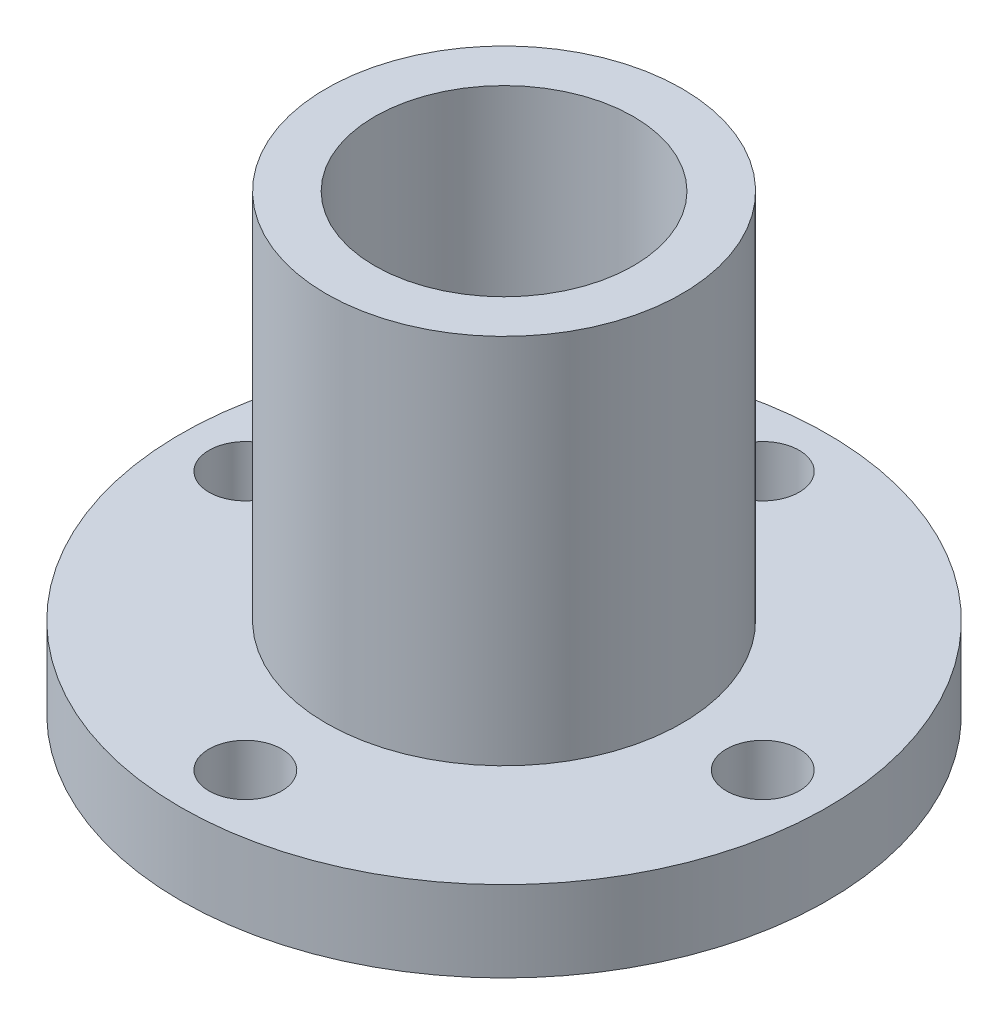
ISO-10303-21;
HEADER;
FILE_DESCRIPTION(('STEP AP214'),'2;1');
FILE_NAME('part.step','',(''),(''),'','','');
FILE_SCHEMA(('AUTOMOTIVE_DESIGN { 1 0 10303 214 1 1 1 1 }'));
ENDSEC;
DATA;
#1=APPLICATION_CONTEXT('core data for automotive mechanical design processes');
#2=APPLICATION_PROTOCOL_DEFINITION('international standard','automotive_design',2000,#1);
#3=PRODUCT_CONTEXT('',#1,'mechanical');
#4=PRODUCT('Part','Part','',(#3));
#5=PRODUCT_RELATED_PRODUCT_CATEGORY('part','',(#4));
#6=PRODUCT_DEFINITION_FORMATION('','',#4);
#7=PRODUCT_DEFINITION_CONTEXT('part definition',#1,'design');
#8=PRODUCT_DEFINITION('design','',#6,#7);
#9=PRODUCT_DEFINITION_SHAPE('','',#8);
#10=(LENGTH_UNIT() NAMED_UNIT(*) SI_UNIT(.MILLI.,.METRE.));
#11=(NAMED_UNIT(*) PLANE_ANGLE_UNIT() SI_UNIT($,.RADIAN.));
#12=(NAMED_UNIT(*) SI_UNIT($,.STERADIAN.) SOLID_ANGLE_UNIT());
#13=UNCERTAINTY_MEASURE_WITH_UNIT(LENGTH_MEASURE(1.E-05),#10,'distance_accuracy_value','');
#14=(GEOMETRIC_REPRESENTATION_CONTEXT(3) GLOBAL_UNCERTAINTY_ASSIGNED_CONTEXT((#13)) GLOBAL_UNIT_ASSIGNED_CONTEXT((#10,
#11,#12)) REPRESENTATION_CONTEXT('',''));
#15=CARTESIAN_POINT('',(0.,0.,0.));
#16=DIRECTION('',(0.,0.,1.));
#17=DIRECTION('',(1.,0.,0.));
#18=AXIS2_PLACEMENT_3D('',#15,#16,#17);
#19=CARTESIAN_POINT('',(0.,28.,0.));
#20=DIRECTION('',(0.,-1.,0.));
#21=DIRECTION('',(0.,0.,-1.));
#22=AXIS2_PLACEMENT_3D('',#19,#20,#21);
#23=CYLINDRICAL_SURFACE('',#22,20.);
#24=CARTESIAN_POINT('',(0.,0.,0.));
#25=DIRECTION('',(0.,1.,0.));
#26=DIRECTION('',(0.,0.,1.));
#27=AXIS2_PLACEMENT_3D('',#24,#25,#26);
#28=CIRCLE('',#27,20.);
#29=CARTESIAN_POINT('',(0.,0.,20.));
#30=VERTEX_POINT('',#29);
#31=EDGE_CURVE('E11',#30,#30,#28,.T.);
#32=ORIENTED_EDGE('',*,*,#31,.T.);
#33=EDGE_LOOP('',(#32));
#34=FACE_BOUND('',#33,.T.);
#35=CARTESIAN_POINT('',(0.,5.,0.));
#36=DIRECTION('',(0.,1.,0.));
#37=DIRECTION('',(0.,0.,1.));
#38=AXIS2_PLACEMENT_3D('',#35,#36,#37);
#39=CIRCLE('',#38,20.);
#40=CARTESIAN_POINT('',(0.,5.,20.));
#41=VERTEX_POINT('',#40);
#42=EDGE_CURVE('E43',#41,#41,#39,.T.);
#43=ORIENTED_EDGE('',*,*,#42,.F.);
#44=EDGE_LOOP('',(#43));
#45=FACE_BOUND('',#44,.T.);
#46=ADVANCED_FACE('F37',(#34,#45),#23,.T.);
#47=CARTESIAN_POINT('',(0.,0.,0.));
#48=DIRECTION('',(0.,1.,0.));
#49=DIRECTION('',(0.,0.,1.));
#50=AXIS2_PLACEMENT_3D('',#47,#48,#49);
#51=PLANE('',#50);
#52=CARTESIAN_POINT('',(0.,0.,16.));
#53=DIRECTION('',(0.,-1.,0.));
#54=DIRECTION('',(0.,0.,-1.));
#55=AXIS2_PLACEMENT_3D('',#52,#53,#54);
#56=CIRCLE('',#55,2.25);
#57=CARTESIAN_POINT('',(0.,0.,13.75));
#58=VERTEX_POINT('',#57);
#59=EDGE_CURVE('E85',#58,#58,#56,.T.);
#60=ORIENTED_EDGE('',*,*,#59,.F.);
#61=EDGE_LOOP('',(#60));
#62=FACE_BOUND('',#61,.T.);
#63=CARTESIAN_POINT('',(16.,0.,0.));
#64=DIRECTION('',(0.,-1.,0.));
#65=DIRECTION('',(0.,0.,-1.));
#66=AXIS2_PLACEMENT_3D('',#63,#64,#65);
#67=CIRCLE('',#66,2.25);
#68=CARTESIAN_POINT('',(16.,0.,-2.25));
#69=VERTEX_POINT('',#68);
#70=EDGE_CURVE('E79',#69,#69,#67,.T.);
#71=ORIENTED_EDGE('',*,*,#70,.F.);
#72=EDGE_LOOP('',(#71));
#73=FACE_BOUND('',#72,.T.);
#74=CARTESIAN_POINT('',(0.,0.,-16.));
#75=DIRECTION('',(0.,-1.,0.));
#76=DIRECTION('',(0.,0.,1.));
#77=AXIS2_PLACEMENT_3D('',#74,#75,#76);
#78=CIRCLE('',#77,2.25);
#79=CARTESIAN_POINT('',(0.,0.,-13.75));
#80=VERTEX_POINT('',#79);
#81=EDGE_CURVE('E74',#80,#80,#78,.T.);
#82=ORIENTED_EDGE('',*,*,#81,.F.);
#83=EDGE_LOOP('',(#82));
#84=FACE_BOUND('',#83,.T.);
#85=CARTESIAN_POINT('',(-16.,0.,0.));
#86=DIRECTION('',(0.,-1.,0.));
#87=DIRECTION('',(0.,0.,1.));
#88=AXIS2_PLACEMENT_3D('',#85,#86,#87);
#89=CIRCLE('',#88,2.25);
#90=CARTESIAN_POINT('',(-16.,0.,2.25));
#91=VERTEX_POINT('',#90);
#92=EDGE_CURVE('E67',#91,#91,#89,.T.);
#93=ORIENTED_EDGE('',*,*,#92,.F.);
#94=EDGE_LOOP('',(#93));
#95=FACE_BOUND('',#94,.T.);
#96=CARTESIAN_POINT('',(0.,0.,0.));
#97=DIRECTION('',(0.,1.,0.));
#98=DIRECTION('',(0.,0.,1.));
#99=AXIS2_PLACEMENT_3D('',#96,#97,#98);
#100=CIRCLE('',#99,8.);
#101=CARTESIAN_POINT('',(0.,0.,8.));
#102=VERTEX_POINT('',#101);
#103=EDGE_CURVE('E54',#102,#102,#100,.T.);
#104=ORIENTED_EDGE('',*,*,#103,.T.);
#105=EDGE_LOOP('',(#104));
#106=FACE_BOUND('',#105,.T.);
#107=ORIENTED_EDGE('',*,*,#31,.F.);
#108=EDGE_LOOP('',(#107));
#109=FACE_BOUND('',#108,.T.);
#110=ADVANCED_FACE('F96',(#62,#73,#84,#95,#106,#109),#51,.F.);
#111=CARTESIAN_POINT('',(0.,5.,0.));
#112=DIRECTION('',(0.,1.,0.));
#113=DIRECTION('',(0.,0.,1.));
#114=AXIS2_PLACEMENT_3D('',#111,#112,#113);
#115=PLANE('',#114);
#116=CARTESIAN_POINT('',(0.,5.,16.));
#117=DIRECTION('',(0.,-1.,0.));
#118=DIRECTION('',(0.,0.,-1.));
#119=AXIS2_PLACEMENT_3D('',#116,#117,#118);
#120=CIRCLE('',#119,2.25);
#121=CARTESIAN_POINT('',(0.,5.,13.75));
#122=VERTEX_POINT('',#121);
#123=EDGE_CURVE('E62',#122,#122,#120,.T.);
#124=ORIENTED_EDGE('',*,*,#123,.T.);
#125=EDGE_LOOP('',(#124));
#126=FACE_BOUND('',#125,.T.);
#127=CARTESIAN_POINT('',(16.,5.,0.));
#128=DIRECTION('',(0.,-1.,0.));
#129=DIRECTION('',(0.,0.,-1.));
#130=AXIS2_PLACEMENT_3D('',#127,#128,#129);
#131=CIRCLE('',#130,2.25);
#132=CARTESIAN_POINT('',(16.,5.,-2.25));
#133=VERTEX_POINT('',#132);
#134=EDGE_CURVE('E77',#133,#133,#131,.T.);
#135=ORIENTED_EDGE('',*,*,#134,.T.);
#136=EDGE_LOOP('',(#135));
#137=FACE_BOUND('',#136,.T.);
#138=CARTESIAN_POINT('',(0.,5.,-16.));
#139=DIRECTION('',(0.,-1.,0.));
#140=DIRECTION('',(0.,0.,1.));
#141=AXIS2_PLACEMENT_3D('',#138,#139,#140);
#142=CIRCLE('',#141,2.25);
#143=CARTESIAN_POINT('',(0.,5.,-13.75));
#144=VERTEX_POINT('',#143);
#145=EDGE_CURVE('E70',#144,#144,#142,.T.);
#146=ORIENTED_EDGE('',*,*,#145,.T.);
#147=EDGE_LOOP('',(#146));
#148=FACE_BOUND('',#147,.T.);
#149=CARTESIAN_POINT('',(-16.,5.,0.));
#150=DIRECTION('',(0.,-1.,0.));
#151=DIRECTION('',(0.,0.,1.));
#152=AXIS2_PLACEMENT_3D('',#149,#150,#151);
#153=CIRCLE('',#152,2.25);
#154=CARTESIAN_POINT('',(-16.,5.,2.25));
#155=VERTEX_POINT('',#154);
#156=EDGE_CURVE('E61',#155,#155,#153,.T.);
#157=ORIENTED_EDGE('',*,*,#156,.T.);
#158=EDGE_LOOP('',(#157));
#159=FACE_BOUND('',#158,.T.);
#160=CARTESIAN_POINT('',(0.,5.,0.));
#161=DIRECTION('',(0.,1.,0.));
#162=DIRECTION('',(0.,0.,1.));
#163=AXIS2_PLACEMENT_3D('',#160,#161,#162);
#164=CIRCLE('',#163,11.);
#165=CARTESIAN_POINT('',(0.,5.,11.));
#166=VERTEX_POINT('',#165);
#167=EDGE_CURVE('E49',#166,#166,#164,.T.);
#168=ORIENTED_EDGE('',*,*,#167,.F.);
#169=EDGE_LOOP('',(#168));
#170=FACE_BOUND('',#169,.T.);
#171=ORIENTED_EDGE('',*,*,#42,.T.);
#172=EDGE_LOOP('',(#171));
#173=FACE_BOUND('',#172,.T.);
#174=ADVANCED_FACE('F89',(#126,#137,#148,#159,#170,#173),#115,.T.);
#175=CARTESIAN_POINT('',(0.,5.,0.));
#176=DIRECTION('',(0.,1.,0.));
#177=DIRECTION('',(0.,0.,1.));
#178=AXIS2_PLACEMENT_3D('',#175,#176,#177);
#179=CYLINDRICAL_SURFACE('',#178,11.);
#180=ORIENTED_EDGE('',*,*,#167,.T.);
#181=EDGE_LOOP('',(#180));
#182=FACE_BOUND('',#181,.T.);
#183=CARTESIAN_POINT('',(0.,28.,0.));
#184=DIRECTION('',(0.,1.,0.));
#185=DIRECTION('',(0.,0.,1.));
#186=AXIS2_PLACEMENT_3D('',#183,#184,#185);
#187=CIRCLE('',#186,11.);
#188=CARTESIAN_POINT('',(0.,28.,11.));
#189=VERTEX_POINT('',#188);
#190=EDGE_CURVE('E55',#189,#189,#187,.T.);
#191=ORIENTED_EDGE('',*,*,#190,.F.);
#192=EDGE_LOOP('',(#191));
#193=FACE_BOUND('',#192,.T.);
#194=ADVANCED_FACE('F119',(#182,#193),#179,.T.);
#195=CARTESIAN_POINT('',(0.,28.,0.));
#196=DIRECTION('',(0.,1.,0.));
#197=DIRECTION('',(0.,0.,1.));
#198=AXIS2_PLACEMENT_3D('',#195,#196,#197);
#199=PLANE('',#198);
#200=CARTESIAN_POINT('',(0.,28.,0.));
#201=DIRECTION('',(0.,1.,0.));
#202=DIRECTION('',(0.,0.,1.));
#203=AXIS2_PLACEMENT_3D('',#200,#201,#202);
#204=CIRCLE('',#203,8.);
#205=CARTESIAN_POINT('',(0.,28.,8.));
#206=VERTEX_POINT('',#205);
#207=EDGE_CURVE('E59',#206,#206,#204,.T.);
#208=ORIENTED_EDGE('',*,*,#207,.F.);
#209=EDGE_LOOP('',(#208));
#210=FACE_BOUND('',#209,.T.);
#211=ORIENTED_EDGE('',*,*,#190,.T.);
#212=EDGE_LOOP('',(#211));
#213=FACE_BOUND('',#212,.T.);
#214=ADVANCED_FACE('F112',(#210,#213),#199,.T.);
#215=CARTESIAN_POINT('',(0.,0.,0.));
#216=DIRECTION('',(0.,1.,0.));
#217=DIRECTION('',(0.,0.,1.));
#218=AXIS2_PLACEMENT_3D('',#215,#216,#217);
#219=CYLINDRICAL_SURFACE('',#218,8.);
#220=ORIENTED_EDGE('',*,*,#103,.F.);
#221=EDGE_LOOP('',(#220));
#222=FACE_BOUND('',#221,.T.);
#223=ORIENTED_EDGE('',*,*,#207,.T.);
#224=EDGE_LOOP('',(#223));
#225=FACE_BOUND('',#224,.T.);
#226=ADVANCED_FACE('F109',(#222,#225),#219,.F.);
#227=CARTESIAN_POINT('',(-16.,5.,0.));
#228=DIRECTION('',(0.,-1.,0.));
#229=DIRECTION('',(0.,0.,-1.));
#230=AXIS2_PLACEMENT_3D('',#227,#228,#229);
#231=CYLINDRICAL_SURFACE('',#230,2.25);
#232=ORIENTED_EDGE('',*,*,#156,.F.);
#233=EDGE_LOOP('',(#232));
#234=FACE_BOUND('',#233,.T.);
#235=ORIENTED_EDGE('',*,*,#92,.T.);
#236=EDGE_LOOP('',(#235));
#237=FACE_BOUND('',#236,.T.);
#238=ADVANCED_FACE('F113',(#234,#237),#231,.F.);
#239=CARTESIAN_POINT('',(0.,5.,-16.));
#240=DIRECTION('',(0.,-1.,0.));
#241=DIRECTION('',(0.,0.,-1.));
#242=AXIS2_PLACEMENT_3D('',#239,#240,#241);
#243=CYLINDRICAL_SURFACE('',#242,2.25);
#244=ORIENTED_EDGE('',*,*,#145,.F.);
#245=EDGE_LOOP('',(#244));
#246=FACE_BOUND('',#245,.T.);
#247=ORIENTED_EDGE('',*,*,#81,.T.);
#248=EDGE_LOOP('',(#247));
#249=FACE_BOUND('',#248,.T.);
#250=ADVANCED_FACE('F165',(#246,#249),#243,.F.);
#251=CARTESIAN_POINT('',(16.,5.,0.));
#252=DIRECTION('',(0.,-1.,0.));
#253=DIRECTION('',(0.,0.,-1.));
#254=AXIS2_PLACEMENT_3D('',#251,#252,#253);
#255=CYLINDRICAL_SURFACE('',#254,2.25);
#256=ORIENTED_EDGE('',*,*,#134,.F.);
#257=EDGE_LOOP('',(#256));
#258=FACE_BOUND('',#257,.T.);
#259=ORIENTED_EDGE('',*,*,#70,.T.);
#260=EDGE_LOOP('',(#259));
#261=FACE_BOUND('',#260,.T.);
#262=ADVANCED_FACE('F93',(#258,#261),#255,.F.);
#263=CARTESIAN_POINT('',(0.,5.,16.));
#264=DIRECTION('',(0.,-1.,0.));
#265=DIRECTION('',(0.,0.,-1.));
#266=AXIS2_PLACEMENT_3D('',#263,#264,#265);
#267=CYLINDRICAL_SURFACE('',#266,2.25);
#268=ORIENTED_EDGE('',*,*,#123,.F.);
#269=EDGE_LOOP('',(#268));
#270=FACE_BOUND('',#269,.T.);
#271=ORIENTED_EDGE('',*,*,#59,.T.);
#272=EDGE_LOOP('',(#271));
#273=FACE_BOUND('',#272,.T.);
#274=ADVANCED_FACE('F91',(#270,#273),#267,.F.);
#275=CLOSED_SHELL('',(#46,#110,#174,#194,#214,#226,#238,#250,#262,#274));
#276=MANIFOLD_SOLID_BREP('B2',#275);
#277=ADVANCED_BREP_SHAPE_REPRESENTATION('',(#18,#276),#14);
#278=SHAPE_DEFINITION_REPRESENTATION(#9,#277);
ENDSEC;
END-ISO-10303-21;
